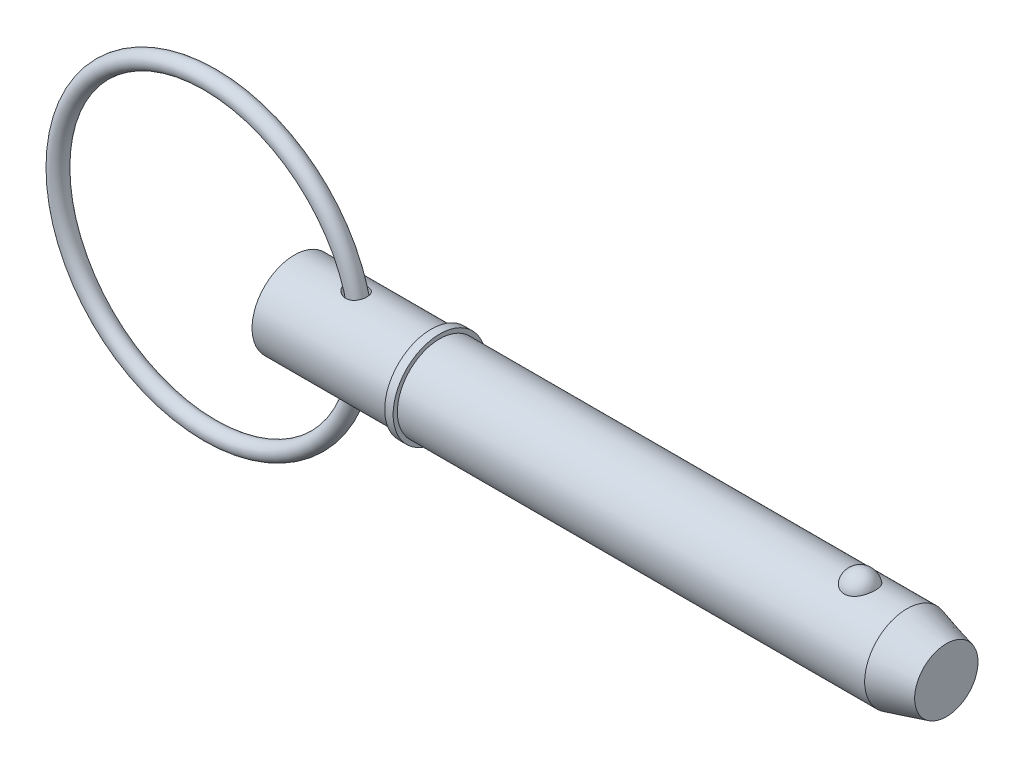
ISO-10303-21;
HEADER;
FILE_DESCRIPTION(('STEP AP214'),'2;1');
FILE_NAME('part.step','',(''),(''),'','','');
FILE_SCHEMA(('AUTOMOTIVE_DESIGN { 1 0 10303 214 1 1 1 1 }'));
ENDSEC;
DATA;
#1=APPLICATION_CONTEXT('core data for automotive mechanical design processes');
#2=APPLICATION_PROTOCOL_DEFINITION('international standard','automotive_design',2000,#1);
#3=PRODUCT_CONTEXT('',#1,'mechanical');
#4=PRODUCT('Part','Part','',(#3));
#5=PRODUCT_RELATED_PRODUCT_CATEGORY('part','',(#4));
#6=PRODUCT_DEFINITION_FORMATION('','',#4);
#7=PRODUCT_DEFINITION_CONTEXT('part definition',#1,'design');
#8=PRODUCT_DEFINITION('design','',#6,#7);
#9=PRODUCT_DEFINITION_SHAPE('','',#8);
#10=(LENGTH_UNIT() NAMED_UNIT(*) SI_UNIT(.MILLI.,.METRE.));
#11=(NAMED_UNIT(*) PLANE_ANGLE_UNIT() SI_UNIT($,.RADIAN.));
#12=(NAMED_UNIT(*) SI_UNIT($,.STERADIAN.) SOLID_ANGLE_UNIT());
#13=UNCERTAINTY_MEASURE_WITH_UNIT(LENGTH_MEASURE(1.E-05),#10,'distance_accuracy_value','');
#14=(GEOMETRIC_REPRESENTATION_CONTEXT(3) GLOBAL_UNCERTAINTY_ASSIGNED_CONTEXT((#13)) GLOBAL_UNIT_ASSIGNED_CONTEXT((#10,
#11,#12)) REPRESENTATION_CONTEXT('',''));
#15=CARTESIAN_POINT('',(0.,0.,0.));
#16=DIRECTION('',(0.,0.,1.));
#17=DIRECTION('',(1.,0.,0.));
#18=AXIS2_PLACEMENT_3D('',#15,#16,#17);
#19=CARTESIAN_POINT('',(-15.855506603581,0.,0.));
#20=DIRECTION('',(0.,0.,1.));
#21=DIRECTION('',(1.,0.,0.));
#22=AXIS2_PLACEMENT_3D('',#19,#20,#21);
#23=TOROIDAL_SURFACE('',#22,28.575,1.588);
#24=CARTESIAN_POINT('',(14.307493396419,0.,0.));
#25=VERTEX_POINT('',#24);
#26=VERTEX_LOOP('',#25);
#27=FACE_BOUND('',#26,.T.);
#28=ADVANCED_FACE('P0_F12',(#27),#23,.T.);
#29=CLOSED_SHELL('',(#28));
#30=MANIFOLD_SOLID_BREP('P0_B1',#29);
#31=CARTESIAN_POINT('',(0.,0.,0.));
#32=DIRECTION('',(1.,0.,0.));
#33=DIRECTION('',(0.,0.,-1.));
#34=AXIS2_PLACEMENT_3D('',#31,#32,#33);
#35=CYLINDRICAL_SURFACE('',#34,7.94);
#36=CARTESIAN_POINT('',(9.9064878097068,7.8609270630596,-1.11777712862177));
#37=CARTESIAN_POINT('',(9.98046148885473,7.84701054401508,-1.21564239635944));
#38=CARTESIAN_POINT('',(10.0632949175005,7.83217804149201,-1.30680329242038));
#39=CARTESIAN_POINT('',(10.243327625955,7.80247884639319,-1.47382688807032));
#40=CARTESIAN_POINT('',(10.3405572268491,7.78761214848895,-1.54965647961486));
#41=CARTESIAN_POINT('',(10.5460150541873,7.75960959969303,-1.6842723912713));
#42=CARTESIAN_POINT('',(10.654212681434,7.74646915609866,-1.74310445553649));
#43=CARTESIAN_POINT('',(10.8789333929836,7.72340979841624,-1.84259563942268));
#44=CARTESIAN_POINT('',(10.9954527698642,7.71348946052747,-1.88326279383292));
#45=CARTESIAN_POINT('',(11.2371543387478,7.69793327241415,-1.94589519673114));
#46=CARTESIAN_POINT('',(11.3624861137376,7.69242163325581,-1.96732022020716));
#47=CARTESIAN_POINT('',(11.6151110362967,7.68708151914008,-1.98809161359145));
#48=CARTESIAN_POINT('',(11.7424035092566,7.68725113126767,-1.98744541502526));
#49=CARTESIAN_POINT('',(11.9871377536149,7.69329740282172,-1.96389977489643));
#50=CARTESIAN_POINT('',(12.1047148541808,7.69883374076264,-1.94232728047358));
#51=CARTESIAN_POINT('',(12.3339179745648,7.7145667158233,-1.87886184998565));
#52=CARTESIAN_POINT('',(12.4455463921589,7.72476145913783,-1.83697717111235));
#53=CARTESIAN_POINT('',(12.6521036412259,7.74778151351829,-1.73721211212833));
#54=CARTESIAN_POINT('',(12.7476463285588,7.76039274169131,-1.68054854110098));
#55=CARTESIAN_POINT('',(12.9274536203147,7.78715828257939,-1.55179691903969));
#56=CARTESIAN_POINT('',(13.0117191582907,7.80131246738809,-1.47971014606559));
#57=CARTESIAN_POINT('',(13.16544092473,7.82932755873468,-1.32341211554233));
#58=CARTESIAN_POINT('',(13.2351086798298,7.84318958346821,-1.23940873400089));
#59=CARTESIAN_POINT('',(13.3595610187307,7.86933512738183,-1.06080152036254));
#60=CARTESIAN_POINT('',(13.4143450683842,7.88161858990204,-0.966197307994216));
#61=CARTESIAN_POINT('',(13.5082288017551,7.90340571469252,-0.767990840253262));
#62=CARTESIAN_POINT('',(13.5471601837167,7.91287927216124,-0.664305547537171));
#63=CARTESIAN_POINT('',(13.6076213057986,7.92785679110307,-0.451705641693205));
#64=CARTESIAN_POINT('',(13.6291504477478,7.93336061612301,-0.3427908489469));
#65=CARTESIAN_POINT('',(13.6544025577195,7.93983472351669,-0.122042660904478));
#66=CARTESIAN_POINT('',(13.6580055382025,7.94077445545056,-0.0101946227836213));
#67=CARTESIAN_POINT('',(13.6469977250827,7.93793630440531,0.212542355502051));
#68=CARTESIAN_POINT('',(13.6323866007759,7.93415833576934,0.323431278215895));
#69=CARTESIAN_POINT('',(13.5852649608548,7.92228583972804,0.541194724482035));
#70=CARTESIAN_POINT('',(13.5527398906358,7.91418780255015,0.648065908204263));
#71=CARTESIAN_POINT('',(13.4705326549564,7.8945509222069,0.854658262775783));
#72=CARTESIAN_POINT('',(13.4208502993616,7.88301204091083,0.954379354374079));
#73=CARTESIAN_POINT('',(13.3056021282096,7.85778224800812,1.14366619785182));
#74=CARTESIAN_POINT('',(13.2400609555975,7.8440946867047,1.23324739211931));
#75=CARTESIAN_POINT('',(13.0946981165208,7.8160855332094,1.39984119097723));
#76=CARTESIAN_POINT('',(13.0148777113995,7.80176399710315,1.47685490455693));
#77=CARTESIAN_POINT('',(12.8438529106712,7.774237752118,1.6154855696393));
#78=CARTESIAN_POINT('',(12.7527554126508,7.76102428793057,1.67723263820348));
#79=CARTESIAN_POINT('',(12.5611987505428,7.73705789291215,1.78453696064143));
#80=CARTESIAN_POINT('',(12.4607407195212,7.72630466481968,1.83009617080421));
#81=CARTESIAN_POINT('',(12.2541997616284,7.70849465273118,1.90371822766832));
#82=CARTESIAN_POINT('',(12.1481665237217,7.7014098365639,1.93191408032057));
#83=CARTESIAN_POINT('',(11.9327851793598,7.69148605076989,1.97105353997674));
#84=CARTESIAN_POINT('',(11.8234367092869,7.68864754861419,1.98199524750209));
#85=CARTESIAN_POINT('',(11.6016024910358,7.68735890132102,1.98698770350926));
#86=CARTESIAN_POINT('',(11.4891069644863,7.68902083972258,1.98060702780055));
#87=CARTESIAN_POINT('',(11.2665484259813,7.6966276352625,1.95083303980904));
#88=CARTESIAN_POINT('',(11.1564861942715,7.70257384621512,1.92743434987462));
#89=CARTESIAN_POINT('',(10.9339966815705,7.71853798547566,1.86251478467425));
#90=CARTESIAN_POINT('',(10.8219140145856,7.72880438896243,1.81987394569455));
#91=CARTESIAN_POINT('',(10.6060441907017,7.75216432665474,1.7176403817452));
#92=CARTESIAN_POINT('',(10.5022611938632,7.76525926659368,1.65803922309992));
#93=CARTESIAN_POINT('',(10.3000447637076,7.79362794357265,1.51929354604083));
#94=CARTESIAN_POINT('',(10.2022480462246,7.80898310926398,1.4392327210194));
#95=CARTESIAN_POINT('',(10.0221668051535,7.83939672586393,1.26310118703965));
#96=CARTESIAN_POINT('',(9.93988168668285,7.85445518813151,1.16703109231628));
#97=CARTESIAN_POINT('',(9.79729823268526,7.88178950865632,0.964874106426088));
#98=CARTESIAN_POINT('',(9.73627994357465,7.89414970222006,0.859310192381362));
#99=CARTESIAN_POINT('',(9.63554001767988,7.91508909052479,0.638143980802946));
#100=CARTESIAN_POINT('',(9.59578986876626,7.92367334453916,0.52255536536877));
#101=CARTESIAN_POINT('',(9.54388714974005,7.93499161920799,0.300466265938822));
#102=CARTESIAN_POINT('',(9.52888458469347,7.93832727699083,0.194660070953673));
#103=CARTESIAN_POINT('',(9.51823078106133,7.94068976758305,-0.0179747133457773));
#104=CARTESIAN_POINT('',(9.52257317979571,7.93971801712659,-0.124802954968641));
#105=CARTESIAN_POINT('',(9.54911264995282,7.93386114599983,-0.326814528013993));
#106=CARTESIAN_POINT('',(9.56976509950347,7.92931471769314,-0.422217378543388));
#107=CARTESIAN_POINT('',(9.62591284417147,7.91721462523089,-0.608271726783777));
#108=CARTESIAN_POINT('',(9.66139801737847,7.90966301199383,-0.698926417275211));
#109=CARTESIAN_POINT('',(9.7317197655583,7.89515389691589,-0.844763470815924));
#110=CARTESIAN_POINT('',(9.76292633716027,7.88881879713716,-0.90180107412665));
#111=CARTESIAN_POINT('',(9.83075962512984,7.87538342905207,-1.01244242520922));
#112=CARTESIAN_POINT('',(9.86738597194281,7.86828321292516,-1.06604640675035));
#113=CARTESIAN_POINT('',(9.9064878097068,7.8609270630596,-1.11777712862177));
#114=B_SPLINE_CURVE_WITH_KNOTS('',3,(#36,#37,#38,#39,#40,#41,#42,#43,#44,#45,#46,#47,#48,#49,
#50,#51,#52,#53,#54,#55,#56,#57,#58,#59,#60,#61,#62,#63,#64,#65,#66,#67,#68,#69,#70,#71,#72,#73,
#74,#75,#76,#77,#78,#79,#80,#81,#82,#83,#84,#85,#86,#87,#88,#89,#90,#91,#92,#93,#94,#95,#96,#97,
#98,#99,#100,#101,#102,#103,#104,#105,#106,#107,#108,#109,#110,#111,#112,#113),.UNSPECIFIED.,
.T.,.F.,(4,2,2,2,2,2,2,2,2,2,2,2,2,2,2,2,2,2,2,2,2,2,2,2,2,2,2,2,2,2,2,2,2,2,2,2,2,2,4),(0.,
0.370138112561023,0.741067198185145,1.11098852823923,1.48074607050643,1.86058657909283,
2.24029919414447,2.59740885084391,2.95437345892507,3.2881332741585,3.62186544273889,
3.95036374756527,4.27887384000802,4.61078596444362,4.94270949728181,5.27685177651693,
5.61100012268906,5.94542035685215,6.27984429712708,6.61375187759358,6.94762997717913,
7.27855592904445,7.60944187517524,7.93776058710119,8.26611544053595,8.60272268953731,
8.93943635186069,9.29895306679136,9.65864886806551,10.0387340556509,10.4188046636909,
10.7843533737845,11.1494107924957,11.4683925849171,11.7872694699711,12.0791172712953,
12.3707662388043,12.5664313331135,12.7620830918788),.UNSPECIFIED.);
#115=CARTESIAN_POINT('',(9.9064878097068,7.8609270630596,-1.11777712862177));
#116=VERTEX_POINT('',#115);
#117=EDGE_CURVE('P1_E42',#116,#116,#114,.T.);
#118=ORIENTED_EDGE('',*,*,#117,.T.);
#119=EDGE_LOOP('',(#118));
#120=FACE_BOUND('',#119,.T.);
#121=CARTESIAN_POINT('',(0.,0.,0.));
#122=DIRECTION('',(1.,0.,0.));
#123=DIRECTION('',(0.,0.,-1.));
#124=AXIS2_PLACEMENT_3D('',#121,#122,#123);
#125=CIRCLE('',#124,7.94);
#126=CARTESIAN_POINT('',(0.,0.,-7.94));
#127=VERTEX_POINT('',#126);
#128=EDGE_CURVE('P1_E9',#127,#127,#125,.T.);
#129=ORIENTED_EDGE('',*,*,#128,.T.);
#130=EDGE_LOOP('',(#129));
#131=FACE_BOUND('',#130,.T.);
#132=CARTESIAN_POINT('',(25.722,0.,0.));
#133=DIRECTION('',(1.,0.,0.));
#134=DIRECTION('',(0.,0.,-1.));
#135=AXIS2_PLACEMENT_3D('',#132,#133,#134);
#136=CIRCLE('',#135,7.94);
#137=CARTESIAN_POINT('',(25.722,0.,-7.94));
#138=VERTEX_POINT('',#137);
#139=EDGE_CURVE('P1_E25',#138,#138,#136,.T.);
#140=ORIENTED_EDGE('',*,*,#139,.F.);
#141=EDGE_LOOP('',(#140));
#142=FACE_BOUND('',#141,.T.);
#143=CARTESIAN_POINT('',(9.9064878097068,-7.8609270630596,-1.11777712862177));
#144=CARTESIAN_POINT('',(9.84378768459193,-7.87272256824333,-1.03482250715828));
#145=CARTESIAN_POINT('',(9.7874122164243,-7.88386682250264,-0.947002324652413));
#146=CARTESIAN_POINT('',(9.68947008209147,-7.90377389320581,-0.763202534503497));
#147=CARTESIAN_POINT('',(9.64789384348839,-7.91253824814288,-0.667228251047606));
#148=CARTESIAN_POINT('',(9.58141396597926,-7.92676779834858,-0.46889851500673));
#149=CARTESIAN_POINT('',(9.55658638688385,-7.93221793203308,-0.36651622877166));
#150=CARTESIAN_POINT('',(9.525398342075,-7.9390896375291,-0.158837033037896));
#151=CARTESIAN_POINT('',(9.51903196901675,-7.94051249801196,-0.0535410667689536));
#152=CARTESIAN_POINT('',(9.5249639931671,-7.93919670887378,0.149856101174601));
#153=CARTESIAN_POINT('',(9.53611757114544,-7.9367132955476,0.24799461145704));
#154=CARTESIAN_POINT('',(9.57435037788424,-7.92833496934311,0.44094918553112));
#155=CARTESIAN_POINT('',(9.60143086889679,-7.92243978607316,0.535764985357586));
#156=CARTESIAN_POINT('',(9.67027872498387,-7.90782830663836,0.720026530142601));
#157=CARTESIAN_POINT('',(9.71210005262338,-7.89910165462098,0.809451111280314));
#158=CARTESIAN_POINT('',(9.80864905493,-7.87966534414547,0.980775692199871));
#159=CARTESIAN_POINT('',(9.86338092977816,-7.86895504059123,1.06267323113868));
#160=CARTESIAN_POINT('',(9.99009906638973,-7.84531573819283,1.22559225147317));
#161=CARTESIAN_POINT('',(10.0632770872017,-7.8322718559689,1.30566871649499));
#162=CARTESIAN_POINT('',(10.2208237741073,-7.80611237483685,1.45392159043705));
#163=CARTESIAN_POINT('',(10.3051986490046,-7.79299674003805,1.52209134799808));
#164=CARTESIAN_POINT('',(10.4935539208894,-7.76638841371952,1.65280871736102));
#165=CARTESIAN_POINT('',(10.5986730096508,-7.75303312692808,1.71374951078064));
#166=CARTESIAN_POINT('',(10.8175805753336,-7.72920597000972,1.81820073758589));
#167=CARTESIAN_POINT('',(10.9313721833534,-7.71873514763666,1.86170483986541));
#168=CARTESIAN_POINT('',(11.1696833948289,-7.70161777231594,1.93133079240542));
#169=CARTESIAN_POINT('',(11.2944525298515,-7.69514907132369,1.95665138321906));
#170=CARTESIAN_POINT('',(11.5466607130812,-7.6877908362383,1.98537345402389));
#171=CARTESIAN_POINT('',(11.6740986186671,-7.68689896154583,1.98878412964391));
#172=CARTESIAN_POINT('',(11.9206005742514,-7.690938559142,1.97309854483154));
#173=CARTESIAN_POINT('',(12.0397453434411,-7.69555832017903,1.95520713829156));
#174=CARTESIAN_POINT('',(12.2727177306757,-7.70968728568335,1.89872693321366));
#175=CARTESIAN_POINT('',(12.3865475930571,-7.71919440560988,1.86014695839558));
#176=CARTESIAN_POINT('',(12.5975118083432,-7.74115679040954,1.76641559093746));
#177=CARTESIAN_POINT('',(12.6952552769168,-7.75336701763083,1.71257254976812));
#178=CARTESIAN_POINT('',(12.8798510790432,-7.77962828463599,1.58901145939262));
#179=CARTESIAN_POINT('',(12.9667044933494,-7.79367914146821,1.51929498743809));
#180=CARTESIAN_POINT('',(13.1254818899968,-7.82172079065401,1.36751778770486));
#181=CARTESIAN_POINT('',(13.1976693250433,-7.83570718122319,1.28573131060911));
#182=CARTESIAN_POINT('',(13.3274495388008,-7.86236718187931,1.11111271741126));
#183=CARTESIAN_POINT('',(13.3850418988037,-7.87504075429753,1.01828028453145));
#184=CARTESIAN_POINT('',(13.4847470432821,-7.89782512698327,0.823214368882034));
#185=CARTESIAN_POINT('',(13.5267056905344,-7.90791011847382,0.72089908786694));
#186=CARTESIAN_POINT('',(13.5933891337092,-7.92427335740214,0.510509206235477));
#187=CARTESIAN_POINT('',(13.6181132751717,-7.9305514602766,0.40243438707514));
#188=CARTESIAN_POINT('',(13.6498843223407,-7.93866355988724,0.182728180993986));
#189=CARTESIAN_POINT('',(13.6567982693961,-7.94046412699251,0.0710763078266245));
#190=CARTESIAN_POINT('',(13.6524060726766,-7.93933046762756,-0.151845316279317));
#191=CARTESIAN_POINT('',(13.6410996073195,-7.93639615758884,-0.263115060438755));
#192=CARTESIAN_POINT('',(13.6005023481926,-7.92610202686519,-0.482238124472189));
#193=CARTESIAN_POINT('',(13.571192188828,-7.91873744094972,-0.590087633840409));
#194=CARTESIAN_POINT('',(13.495246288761,-7.90037565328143,-0.799178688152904));
#195=CARTESIAN_POINT('',(13.4486102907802,-7.88937839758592,-0.900420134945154));
#196=CARTESIAN_POINT('',(13.3391817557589,-7.86497175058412,-1.09328280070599));
#197=CARTESIAN_POINT('',(13.2764083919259,-7.85156522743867,-1.18491525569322));
#198=CARTESIAN_POINT('',(13.1362355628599,-7.8238261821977,-1.35604994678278));
#199=CARTESIAN_POINT('',(13.0588372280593,-7.80949373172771,-1.43555311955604));
#200=CARTESIAN_POINT('',(12.8921392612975,-7.78164292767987,-1.57955181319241));
#201=CARTESIAN_POINT('',(12.8029410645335,-7.76811892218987,-1.64416363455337));
#202=CARTESIAN_POINT('',(12.6146622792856,-7.74328422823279,-1.75742016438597));
#203=CARTESIAN_POINT('',(12.5155829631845,-7.73197325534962,-1.80606692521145));
#204=CARTESIAN_POINT('',(12.31135301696,-7.71289290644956,-1.88588502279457));
#205=CARTESIAN_POINT('',(12.2062651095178,-7.70509254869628,-1.91720981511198));
#206=CARTESIAN_POINT('',(11.9922253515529,-7.69365188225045,-1.96261878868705));
#207=CARTESIAN_POINT('',(11.8832731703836,-7.69001193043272,-1.97670149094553));
#208=CARTESIAN_POINT('',(11.662174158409,-7.6871142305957,-1.98794112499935));
#209=CARTESIAN_POINT('',(11.5500082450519,-7.6879499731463,-1.98473694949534));
#210=CARTESIAN_POINT('',(11.3276038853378,-7.69396349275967,-1.96129119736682));
#211=CARTESIAN_POINT('',(11.2173659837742,-7.6991424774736,-1.94104488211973));
#212=CARTESIAN_POINT('',(10.9943151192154,-7.71363470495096,-1.8826578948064));
#213=CARTESIAN_POINT('',(10.8818004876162,-7.72319478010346,-1.8434396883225));
#214=CARTESIAN_POINT('',(10.6644693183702,-7.74534199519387,-1.74804607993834));
#215=CARTESIAN_POINT('',(10.5596578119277,-7.75793109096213,-1.69185971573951));
#216=CARTESIAN_POINT('',(10.3538333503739,-7.78563853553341,-1.55958016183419));
#217=CARTESIAN_POINT('',(10.2535123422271,-7.80086820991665,-1.48242881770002));
#218=CARTESIAN_POINT('',(10.0678634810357,-7.83136022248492,-1.31182139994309));
#219=CARTESIAN_POINT('',(9.98252491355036,-7.84662252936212,-1.21837707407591));
#220=CARTESIAN_POINT('',(9.9064878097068,-7.8609270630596,-1.11777712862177));
#221=B_SPLINE_CURVE_WITH_KNOTS('',3,(#143,#144,#145,#146,#147,#148,#149,#150,#151,#152,#153,
#154,#155,#156,#157,#158,#159,#160,#161,#162,#163,#164,#165,#166,#167,#168,#169,#170,#171,#172,
#173,#174,#175,#176,#177,#178,#179,#180,#181,#182,#183,#184,#185,#186,#187,#188,#189,#190,#191,
#192,#193,#194,#195,#196,#197,#198,#199,#200,#201,#202,#203,#204,#205,#206,#207,#208,#209,#210,
#211,#212,#213,#214,#215,#216,#217,#218,#219,#220),.UNSPECIFIED.,.T.,.F.,(4,2,2,2,2,2,2,2,2,2,2,
2,2,2,2,2,2,2,2,2,2,2,2,2,2,2,2,2,2,2,2,2,2,2,2,2,2,2,4),(0.,0.313593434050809,
0.626983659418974,0.941787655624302,1.25649090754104,1.55146990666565,1.84647228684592,
2.14256601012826,2.43875619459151,2.76521830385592,3.09186220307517,3.45696288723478,
3.82219601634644,4.20267276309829,4.58298981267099,4.94277962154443,5.30241610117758,
5.63754619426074,5.9726430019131,6.30104941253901,6.62946524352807,6.96103833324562,
7.29262401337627,7.62667800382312,7.96073789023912,8.29515773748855,8.62958255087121,
8.96361184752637,9.29761533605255,9.62891449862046,9.96017105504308,10.288443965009,
10.616745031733,10.951930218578,11.2872086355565,11.6442788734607,12.0015802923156,
12.3821516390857,12.762449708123),.UNSPECIFIED.);
#222=CARTESIAN_POINT('',(9.9064878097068,-7.8609270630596,-1.11777712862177));
#223=VERTEX_POINT('',#222);
#224=EDGE_CURVE('P1_E17',#223,#223,#221,.T.);
#225=ORIENTED_EDGE('',*,*,#224,.T.);
#226=EDGE_LOOP('',(#225));
#227=FACE_BOUND('',#226,.T.);
#228=ADVANCED_FACE('P1_F13',(#120,#131,#142,#227),#35,.T.);
#229=CARTESIAN_POINT('',(0.,0.,0.));
#230=DIRECTION('',(1.,0.,0.));
#231=DIRECTION('',(0.,0.,-1.));
#232=AXIS2_PLACEMENT_3D('',#229,#230,#231);
#233=CYLINDRICAL_SURFACE('',#232,7.94);
#234=CARTESIAN_POINT('',(115.151879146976,0.,0.));
#235=DIRECTION('',(1.,0.,0.));
#236=DIRECTION('',(0.,0.,-1.));
#237=AXIS2_PLACEMENT_3D('',#234,#235,#236);
#238=CIRCLE('',#237,7.94);
#239=CARTESIAN_POINT('',(115.151879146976,0.,-7.94));
#240=VERTEX_POINT('',#239);
#241=EDGE_CURVE('P1_E99',#240,#240,#238,.T.);
#242=ORIENTED_EDGE('',*,*,#241,.F.);
#243=EDGE_LOOP('',(#242));
#244=FACE_BOUND('',#243,.T.);
#245=CARTESIAN_POINT('',(27.31,0.,0.));
#246=DIRECTION('',(1.,0.,0.));
#247=DIRECTION('',(0.,0.,-1.));
#248=AXIS2_PLACEMENT_3D('',#245,#246,#247);
#249=CIRCLE('',#248,7.94);
#250=CARTESIAN_POINT('',(27.31,0.,-7.94));
#251=VERTEX_POINT('',#250);
#252=EDGE_CURVE('P1_E96',#251,#251,#249,.T.);
#253=ORIENTED_EDGE('',*,*,#252,.T.);
#254=EDGE_LOOP('',(#253));
#255=FACE_BOUND('',#254,.T.);
#256=CARTESIAN_POINT('',(106.344907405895,7.37767842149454,2.93486986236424));
#257=CARTESIAN_POINT('',(106.192749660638,7.37767329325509,2.9348750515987));
#258=CARTESIAN_POINT('',(106.040632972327,7.38258419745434,2.92262454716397));
#259=CARTESIAN_POINT('',(105.740928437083,7.40163229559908,2.87404196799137));
#260=CARTESIAN_POINT('',(105.593339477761,7.41576720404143,2.83771585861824));
#261=CARTESIAN_POINT('',(105.307018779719,7.45161576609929,2.74218769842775));
#262=CARTESIAN_POINT('',(105.168274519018,7.47331841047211,2.68301886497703));
#263=CARTESIAN_POINT('',(104.902882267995,7.52194082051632,2.54350967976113));
#264=CARTESIAN_POINT('',(104.776236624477,7.54886159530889,2.46316523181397));
#265=CARTESIAN_POINT('',(104.534534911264,7.60594671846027,2.28090375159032));
#266=CARTESIAN_POINT('',(104.419906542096,7.63618114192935,2.17844211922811));
#267=CARTESIAN_POINT('',(104.208878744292,7.69614046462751,1.95608495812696));
#268=CARTESIAN_POINT('',(104.112482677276,7.72586526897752,1.83618622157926));
#269=CARTESIAN_POINT('',(103.935938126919,7.78314821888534,1.57628086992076));
#270=CARTESIAN_POINT('',(103.856707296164,7.81055035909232,1.43561546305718));
#271=CARTESIAN_POINT('',(103.721797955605,7.85879631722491,1.14236334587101));
#272=CARTESIAN_POINT('',(103.666121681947,7.87963951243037,0.989775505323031));
#273=CARTESIAN_POINT('',(103.57881215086,7.91289645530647,0.674619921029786));
#274=CARTESIAN_POINT('',(103.54753090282,7.92518652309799,0.511941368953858));
#275=CARTESIAN_POINT('',(103.510975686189,7.93958930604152,0.183247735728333));
#276=CARTESIAN_POINT('',(103.505701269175,7.94170219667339,0.0172327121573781));
#277=CARTESIAN_POINT('',(103.521231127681,7.93554931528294,-0.312672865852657));
#278=CARTESIAN_POINT('',(103.541925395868,7.92732732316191,-0.476569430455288));
#279=CARTESIAN_POINT('',(103.60878655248,7.90141534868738,-0.798305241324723));
#280=CARTESIAN_POINT('',(103.654953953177,7.88372517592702,-0.956144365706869));
#281=CARTESIAN_POINT('',(103.771898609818,7.84066230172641,-1.26152073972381));
#282=CARTESIAN_POINT('',(103.842704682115,7.81528060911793,-1.40904568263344));
#283=CARTESIAN_POINT('',(104.007478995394,7.7594867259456,-1.68950598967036));
#284=CARTESIAN_POINT('',(104.101448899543,7.72907417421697,-1.82244030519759));
#285=CARTESIAN_POINT('',(104.310839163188,7.66640424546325,-2.07032792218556));
#286=CARTESIAN_POINT('',(104.426315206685,7.63414223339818,-2.18523308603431));
#287=CARTESIAN_POINT('',(104.6759006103,7.57149681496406,-2.39329737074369));
#288=CARTESIAN_POINT('',(104.810008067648,7.54111321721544,-2.48645870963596));
#289=CARTESIAN_POINT('',(105.090111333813,7.48650742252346,-2.64628132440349));
#290=CARTESIAN_POINT('',(105.235760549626,7.46215900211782,-2.71350554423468));
#291=CARTESIAN_POINT('',(105.537425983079,7.42171253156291,-2.82226614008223));
#292=CARTESIAN_POINT('',(105.693438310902,7.40561140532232,-2.86381209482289));
#293=CARTESIAN_POINT('',(106.002970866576,7.3842679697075,-2.91839077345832));
#294=CARTESIAN_POINT('',(106.156222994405,7.37852109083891,-2.93275024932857));
#295=CARTESIAN_POINT('',(106.463070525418,7.37700973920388,-2.93655208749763));
#296=CARTESIAN_POINT('',(106.616665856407,7.38124333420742,-2.92599927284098));
#297=CARTESIAN_POINT('',(106.914990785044,7.39890635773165,-2.88102897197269));
#298=CARTESIAN_POINT('',(107.059848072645,7.41205491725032,-2.84733999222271));
#299=CARTESIAN_POINT('',(107.34164329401,7.44580110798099,-2.75788206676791));
#300=CARTESIAN_POINT('',(107.478580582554,7.46639934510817,-2.70211132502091));
#301=CARTESIAN_POINT('',(107.744061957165,7.51339098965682,-2.56858908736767));
#302=CARTESIAN_POINT('',(107.872354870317,7.5399020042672,-2.49038067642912));
#303=CARTESIAN_POINT('',(108.114244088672,7.59569503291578,-2.31462737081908));
#304=CARTESIAN_POINT('',(108.227837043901,7.6249776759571,-2.21707808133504));
#305=CARTESIAN_POINT('',(108.44322156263,7.68489473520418,-1.99982049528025));
#306=CARTESIAN_POINT('',(108.544148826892,7.71552419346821,-1.87925337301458));
#307=CARTESIAN_POINT('',(108.725186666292,7.77353016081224,-1.6226882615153));
#308=CARTESIAN_POINT('',(108.805293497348,7.80090608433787,-1.48668750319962));
#309=CARTESIAN_POINT('',(108.945361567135,7.85047992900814,-1.1981841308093));
#310=CARTESIAN_POINT('',(109.004587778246,7.87248183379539,-1.04529016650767));
#311=CARTESIAN_POINT('',(109.097982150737,7.90785114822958,-0.731080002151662));
#312=CARTESIAN_POINT('',(109.132149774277,7.92121837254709,-0.569763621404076));
#313=CARTESIAN_POINT('',(109.174795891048,7.93797834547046,-0.242812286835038));
#314=CARTESIAN_POINT('',(109.183204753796,7.94134405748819,-0.0771668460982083));
#315=CARTESIAN_POINT('',(109.173962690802,7.93767937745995,0.253276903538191));
#316=CARTESIAN_POINT('',(109.156312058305,7.93064910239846,0.418075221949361));
#317=CARTESIAN_POINT('',(109.095424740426,7.90695571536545,0.741525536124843));
#318=CARTESIAN_POINT('',(109.052281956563,7.8903279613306,0.900197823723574));
#319=CARTESIAN_POINT('',(108.94135358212,7.84916386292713,1.20759654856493));
#320=CARTESIAN_POINT('',(108.87356656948,7.82462706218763,1.35632241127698));
#321=CARTESIAN_POINT('',(108.714371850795,7.7700669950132,1.64032869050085));
#322=CARTESIAN_POINT('',(108.622861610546,7.7400200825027,1.77554712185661));
#323=CARTESIAN_POINT('',(108.418296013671,7.67774175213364,2.02800648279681));
#324=CARTESIAN_POINT('',(108.305241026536,7.64551037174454,2.14524772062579));
#325=CARTESIAN_POINT('',(108.060831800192,7.58265895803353,2.35778002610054));
#326=CARTESIAN_POINT('',(107.929583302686,7.5520309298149,2.45319004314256));
#327=CARTESIAN_POINT('',(107.651601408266,7.49579792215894,2.61999897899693));
#328=CARTESIAN_POINT('',(107.504867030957,7.47019326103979,2.69139637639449));
#329=CARTESIAN_POINT('',(107.192947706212,7.42622216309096,2.81053241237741));
#330=CARTESIAN_POINT('',(107.027220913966,7.40825002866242,2.85700910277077));
#331=CARTESIAN_POINT('',(106.689279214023,7.38398348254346,2.91916850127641));
#332=CARTESIAN_POINT('',(106.51706702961,7.37768422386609,2.93486399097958));
#333=CARTESIAN_POINT('',(106.344907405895,7.37767842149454,2.93486986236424));
#334=B_SPLINE_CURVE_WITH_KNOTS('',3,(#256,#257,#258,#259,#260,#261,#262,#263,#264,#265,#266,
#267,#268,#269,#270,#271,#272,#273,#274,#275,#276,#277,#278,#279,#280,#281,#282,#283,#284,#285,
#286,#287,#288,#289,#290,#291,#292,#293,#294,#295,#296,#297,#298,#299,#300,#301,#302,#303,#304,
#305,#306,#307,#308,#309,#310,#311,#312,#313,#314,#315,#316,#317,#318,#319,#320,#321,#322,#323,
#324,#325,#326,#327,#328,#329,#330,#331,#332,#333),.UNSPECIFIED.,.T.,.F.,(4,2,2,2,2,2,2,2,2,2,2,
2,2,2,2,2,2,2,2,2,2,2,2,2,2,2,2,2,2,2,2,2,2,2,2,2,2,2,4),(0.,0.455841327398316,
0.911569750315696,1.36663794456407,1.8217942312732,2.28978983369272,2.75787163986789,
3.24685368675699,3.73588214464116,4.23184282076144,4.7277949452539,5.22165321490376,
5.715521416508,6.20996917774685,6.70445245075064,7.20023431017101,7.69596557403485,
8.18023418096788,8.66432203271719,9.12410697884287,9.58380291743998,10.0296503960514,
10.475534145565,10.9312349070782,11.3870393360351,11.8654416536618,12.3439299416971,
12.8378875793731,13.3318558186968,13.8271581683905,14.3224549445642,14.8159385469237,
15.3094506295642,15.8051323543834,16.3008055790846,16.7937101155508,17.2866458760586,
17.8026240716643,18.3183879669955),.UNSPECIFIED.);
#335=CARTESIAN_POINT('',(106.344907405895,7.37767842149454,2.93486986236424));
#336=VERTEX_POINT('',#335);
#337=EDGE_CURVE('P1_E34',#336,#336,#334,.T.);
#338=ORIENTED_EDGE('',*,*,#337,.T.);
#339=EDGE_LOOP('',(#338));
#340=FACE_BOUND('',#339,.T.);
#341=ADVANCED_FACE('P1_F46',(#244,#255,#340),#233,.T.);
#342=CARTESIAN_POINT('',(0.,0.,0.));
#343=DIRECTION('',(-1.,0.,0.));
#344=DIRECTION('',(0.,0.,1.));
#345=AXIS2_PLACEMENT_3D('',#342,#343,#344);
#346=PLANE('',#345);
#347=ORIENTED_EDGE('',*,*,#128,.F.);
#348=EDGE_LOOP('',(#347));
#349=FACE_BOUND('',#348,.T.);
#350=ADVANCED_FACE('P1_F15',(#349),#346,.T.);
#351=CARTESIAN_POINT('',(25.722,7.94,0.));
#352=DIRECTION('',(-1.,0.,0.));
#353=DIRECTION('',(0.,0.,1.));
#354=AXIS2_PLACEMENT_3D('',#351,#352,#353);
#355=PLANE('',#354);
#356=ORIENTED_EDGE('',*,*,#139,.T.);
#357=EDGE_LOOP('',(#356));
#358=FACE_BOUND('',#357,.T.);
#359=CARTESIAN_POINT('',(25.722,0.,0.));
#360=DIRECTION('',(1.,0.,0.));
#361=DIRECTION('',(0.,0.,-1.));
#362=AXIS2_PLACEMENT_3D('',#359,#360,#361);
#363=CIRCLE('',#362,8.734);
#364=CARTESIAN_POINT('',(25.722,0.,-8.734));
#365=VERTEX_POINT('',#364);
#366=EDGE_CURVE('P1_E30',#365,#365,#363,.T.);
#367=ORIENTED_EDGE('',*,*,#366,.F.);
#368=EDGE_LOOP('',(#367));
#369=FACE_BOUND('',#368,.T.);
#370=ADVANCED_FACE('P1_F81',(#358,#369),#355,.T.);
#371=CARTESIAN_POINT('',(0.,0.,0.));
#372=DIRECTION('',(1.,0.,0.));
#373=DIRECTION('',(0.,0.,-1.));
#374=AXIS2_PLACEMENT_3D('',#371,#372,#373);
#375=CYLINDRICAL_SURFACE('',#374,8.734);
#376=ORIENTED_EDGE('',*,*,#366,.T.);
#377=EDGE_LOOP('',(#376));
#378=FACE_BOUND('',#377,.T.);
#379=CARTESIAN_POINT('',(27.31,0.,0.));
#380=DIRECTION('',(1.,0.,0.));
#381=DIRECTION('',(0.,0.,-1.));
#382=AXIS2_PLACEMENT_3D('',#379,#380,#381);
#383=CIRCLE('',#382,8.734);
#384=CARTESIAN_POINT('',(27.31,0.,-8.734));
#385=VERTEX_POINT('',#384);
#386=EDGE_CURVE('P1_E95',#385,#385,#383,.T.);
#387=ORIENTED_EDGE('',*,*,#386,.F.);
#388=EDGE_LOOP('',(#387));
#389=FACE_BOUND('',#388,.T.);
#390=ADVANCED_FACE('P1_F68',(#378,#389),#375,.T.);
#391=CARTESIAN_POINT('',(27.31,8.734,0.));
#392=DIRECTION('',(1.,0.,0.));
#393=DIRECTION('',(0.,0.,-1.));
#394=AXIS2_PLACEMENT_3D('',#391,#392,#393);
#395=PLANE('',#394);
#396=ORIENTED_EDGE('',*,*,#386,.T.);
#397=EDGE_LOOP('',(#396));
#398=FACE_BOUND('',#397,.T.);
#399=ORIENTED_EDGE('',*,*,#252,.F.);
#400=EDGE_LOOP('',(#399));
#401=FACE_BOUND('',#400,.T.);
#402=ADVANCED_FACE('P1_F62',(#398,#401),#395,.T.);
#403=CARTESIAN_POINT('',(122.56,0.,0.));
#404=DIRECTION('',(-1.,0.,0.));
#405=DIRECTION('',(0.,0.,1.));
#406=AXIS2_PLACEMENT_3D('',#403,#404,#405);
#407=CONICAL_SURFACE('',#406,5.95500000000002,0.261799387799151);
#408=ORIENTED_EDGE('',*,*,#241,.T.);
#409=EDGE_LOOP('',(#408));
#410=FACE_BOUND('',#409,.T.);
#411=CARTESIAN_POINT('',(122.56,0.,0.));
#412=DIRECTION('',(1.,0.,0.));
#413=DIRECTION('',(0.,0.,-1.));
#414=AXIS2_PLACEMENT_3D('',#411,#412,#413);
#415=CIRCLE('',#414,5.95500000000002);
#416=CARTESIAN_POINT('',(122.56,0.,-5.95500000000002));
#417=VERTEX_POINT('',#416);
#418=EDGE_CURVE('P1_E41',#417,#417,#415,.T.);
#419=ORIENTED_EDGE('',*,*,#418,.F.);
#420=EDGE_LOOP('',(#419));
#421=FACE_BOUND('',#420,.T.);
#422=ADVANCED_FACE('P1_F59',(#410,#421),#407,.T.);
#423=CARTESIAN_POINT('',(122.56,5.95500000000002,0.));
#424=DIRECTION('',(1.,0.,0.));
#425=DIRECTION('',(0.,0.,-1.));
#426=AXIS2_PLACEMENT_3D('',#423,#424,#425);
#427=PLANE('',#426);
#428=ORIENTED_EDGE('',*,*,#418,.T.);
#429=EDGE_LOOP('',(#428));
#430=FACE_BOUND('',#429,.T.);
#431=ADVANCED_FACE('P1_F55',(#430),#427,.T.);
#432=CARTESIAN_POINT('',(106.344907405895,7.14599999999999,0.));
#433=DIRECTION('',(-1.,0.,0.));
#434=DIRECTION('',(0.,-1.,0.));
#435=AXIS2_PLACEMENT_3D('',#432,#433,#434);
#436=SPHERICAL_SURFACE('',#435,2.94400000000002);
#437=ORIENTED_EDGE('',*,*,#337,.F.);
#438=EDGE_LOOP('',(#437));
#439=FACE_BOUND('',#438,.T.);
#440=ADVANCED_FACE('P1_F50',(#439),#436,.T.);
#441=CARTESIAN_POINT('',(-15.855506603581,0.,0.));
#442=DIRECTION('',(0.,0.,1.));
#443=DIRECTION('',(1.,0.,0.));
#444=AXIS2_PLACEMENT_3D('',#441,#442,#443);
#445=TOROIDAL_SURFACE('',#444,28.575,1.985);
#446=ORIENTED_EDGE('',*,*,#224,.F.);
#447=EDGE_LOOP('',(#446));
#448=FACE_BOUND('',#447,.T.);
#449=ORIENTED_EDGE('',*,*,#117,.F.);
#450=EDGE_LOOP('',(#449));
#451=FACE_BOUND('',#450,.T.);
#452=ADVANCED_FACE('P1_F54',(#448,#451),#445,.F.);
#453=CLOSED_SHELL('',(#228,#341,#350,#370,#390,#402,#422,#431,#440,#452));
#454=MANIFOLD_SOLID_BREP('P1_B1',#453);
#455=ADVANCED_BREP_SHAPE_REPRESENTATION('',(#18,#30,#454),#14);
#456=SHAPE_DEFINITION_REPRESENTATION(#9,#455);
ENDSEC;
END-ISO-10303-21;
